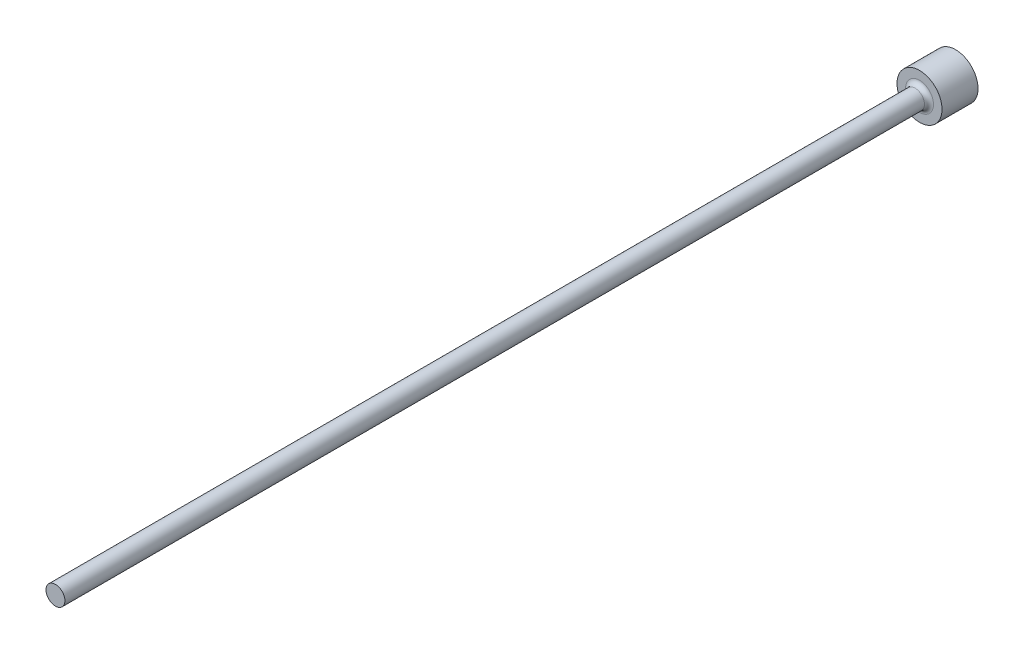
ISO-10303-21;
HEADER;
FILE_DESCRIPTION(('STEP AP214'),'2;1');
FILE_NAME('part.step','',(''),(''),'','','');
FILE_SCHEMA(('AUTOMOTIVE_DESIGN { 1 0 10303 214 1 1 1 1 }'));
ENDSEC;
DATA;
#1=APPLICATION_CONTEXT('core data for automotive mechanical design processes');
#2=APPLICATION_PROTOCOL_DEFINITION('international standard','automotive_design',2000,#1);
#3=PRODUCT_CONTEXT('',#1,'mechanical');
#4=PRODUCT('Part','Part','',(#3));
#5=PRODUCT_RELATED_PRODUCT_CATEGORY('part','',(#4));
#6=PRODUCT_DEFINITION_FORMATION('','',#4);
#7=PRODUCT_DEFINITION_CONTEXT('part definition',#1,'design');
#8=PRODUCT_DEFINITION('design','',#6,#7);
#9=PRODUCT_DEFINITION_SHAPE('','',#8);
#10=(LENGTH_UNIT() NAMED_UNIT(*) SI_UNIT(.MILLI.,.METRE.));
#11=(NAMED_UNIT(*) PLANE_ANGLE_UNIT() SI_UNIT($,.RADIAN.));
#12=(NAMED_UNIT(*) SI_UNIT($,.STERADIAN.) SOLID_ANGLE_UNIT());
#13=UNCERTAINTY_MEASURE_WITH_UNIT(LENGTH_MEASURE(1.E-05),#10,'distance_accuracy_value','');
#14=(GEOMETRIC_REPRESENTATION_CONTEXT(3) GLOBAL_UNCERTAINTY_ASSIGNED_CONTEXT((#13)) GLOBAL_UNIT_ASSIGNED_CONTEXT((#10,
#11,#12)) REPRESENTATION_CONTEXT('',''));
#15=CARTESIAN_POINT('',(0.,0.,0.));
#16=DIRECTION('',(0.,0.,1.));
#17=DIRECTION('',(1.,0.,0.));
#18=AXIS2_PLACEMENT_3D('',#15,#16,#17);
#19=CARTESIAN_POINT('',(2.5,0.,4.));
#20=DIRECTION('',(0.,0.,-1.));
#21=DIRECTION('',(-1.,0.,0.));
#22=AXIS2_PLACEMENT_3D('',#19,#20,#21);
#23=PLANE('',#22);
#24=CARTESIAN_POINT('',(0.,0.,4.));
#25=DIRECTION('',(0.,0.,-1.));
#26=DIRECTION('',(-1.,0.,0.));
#27=AXIS2_PLACEMENT_3D('',#24,#25,#26);
#28=CIRCLE('',#27,1.55000000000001);
#29=CARTESIAN_POINT('',(-1.55000000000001,0.,4.));
#30=VERTEX_POINT('',#29);
#31=EDGE_CURVE('E40',#30,#30,#28,.T.);
#32=ORIENTED_EDGE('',*,*,#31,.T.);
#33=EDGE_LOOP('',(#32));
#34=FACE_BOUND('',#33,.T.);
#35=CARTESIAN_POINT('',(0.,0.,4.));
#36=DIRECTION('',(0.,0.,-1.));
#37=DIRECTION('',(-1.,0.,0.));
#38=AXIS2_PLACEMENT_3D('',#35,#36,#37);
#39=CIRCLE('',#38,2.5);
#40=CARTESIAN_POINT('',(-2.5,0.,4.));
#41=VERTEX_POINT('',#40);
#42=EDGE_CURVE('E44',#41,#41,#39,.T.);
#43=ORIENTED_EDGE('',*,*,#42,.F.);
#44=EDGE_LOOP('',(#43));
#45=FACE_BOUND('',#44,.T.);
#46=ADVANCED_FACE('F33',(#34,#45),#23,.F.);
#47=CARTESIAN_POINT('',(0.,0.,-9.03322817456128));
#48=DIRECTION('',(0.,0.,-1.));
#49=DIRECTION('',(-1.,0.,0.));
#50=AXIS2_PLACEMENT_3D('',#47,#48,#49);
#51=CYLINDRICAL_SURFACE('',#50,2.5);
#52=CARTESIAN_POINT('',(0.,0.,0.));
#53=DIRECTION('',(0.,0.,-1.));
#54=DIRECTION('',(-1.,0.,0.));
#55=AXIS2_PLACEMENT_3D('',#52,#53,#54);
#56=CIRCLE('',#55,2.5);
#57=CARTESIAN_POINT('',(-2.5,0.,0.));
#58=VERTEX_POINT('',#57);
#59=EDGE_CURVE('E48',#58,#58,#56,.T.);
#60=ORIENTED_EDGE('',*,*,#59,.F.);
#61=EDGE_LOOP('',(#60));
#62=FACE_BOUND('',#61,.T.);
#63=ORIENTED_EDGE('',*,*,#42,.T.);
#64=EDGE_LOOP('',(#63));
#65=FACE_BOUND('',#64,.T.);
#66=ADVANCED_FACE('F68',(#62,#65),#51,.T.);
#67=CARTESIAN_POINT('',(0.,0.,0.));
#68=DIRECTION('',(0.,0.,1.));
#69=DIRECTION('',(1.,0.,0.));
#70=AXIS2_PLACEMENT_3D('',#67,#68,#69);
#71=PLANE('',#70);
#72=ORIENTED_EDGE('',*,*,#59,.T.);
#73=EDGE_LOOP('',(#72));
#74=FACE_BOUND('',#73,.T.);
#75=ADVANCED_FACE('F61',(#74),#71,.F.);
#76=CARTESIAN_POINT('',(0.,0.,100.));
#77=DIRECTION('',(0.,0.,-1.));
#78=DIRECTION('',(-1.,0.,0.));
#79=AXIS2_PLACEMENT_3D('',#76,#77,#78);
#80=PLANE('',#79);
#81=CARTESIAN_POINT('',(0.,0.,100.));
#82=DIRECTION('',(0.,0.,-1.));
#83=DIRECTION('',(-1.,0.,0.));
#84=AXIS2_PLACEMENT_3D('',#81,#82,#83);
#85=CIRCLE('',#84,1.05000000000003);
#86=CARTESIAN_POINT('',(-1.05000000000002,0.,100.));
#87=VERTEX_POINT('',#86);
#88=EDGE_CURVE('E53',#87,#87,#85,.T.);
#89=ORIENTED_EDGE('',*,*,#88,.F.);
#90=EDGE_LOOP('',(#89));
#91=FACE_BOUND('',#90,.T.);
#92=ADVANCED_FACE('F59',(#91),#80,.F.);
#93=CARTESIAN_POINT('',(0.,0.,-9.03322817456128));
#94=DIRECTION('',(0.,0.,-1.));
#95=DIRECTION('',(-1.,0.,0.));
#96=AXIS2_PLACEMENT_3D('',#93,#94,#95);
#97=CYLINDRICAL_SURFACE('',#96,1.05000000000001);
#98=CARTESIAN_POINT('',(0.,0.,4.5));
#99=DIRECTION('',(0.,0.,-1.));
#100=DIRECTION('',(-1.,0.,0.));
#101=AXIS2_PLACEMENT_3D('',#98,#99,#100);
#102=CIRCLE('',#101,1.05000000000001);
#103=CARTESIAN_POINT('',(-1.05000000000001,0.,4.5));
#104=VERTEX_POINT('',#103);
#105=EDGE_CURVE('E10',#104,#104,#102,.F.);
#106=ORIENTED_EDGE('',*,*,#105,.T.);
#107=EDGE_LOOP('',(#106));
#108=FACE_BOUND('',#107,.T.);
#109=ORIENTED_EDGE('',*,*,#88,.T.);
#110=EDGE_LOOP('',(#109));
#111=FACE_BOUND('',#110,.T.);
#112=ADVANCED_FACE('F57',(#108,#111),#97,.T.);
#113=CARTESIAN_POINT('',(0.,0.,4.5));
#114=DIRECTION('',(0.,0.,-1.));
#115=DIRECTION('',(-1.,0.,0.));
#116=AXIS2_PLACEMENT_3D('',#113,#114,#115);
#117=TOROIDAL_SURFACE('',#116,1.55000000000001,0.5);
#118=ORIENTED_EDGE('',*,*,#105,.F.);
#119=EDGE_LOOP('',(#118));
#120=FACE_BOUND('',#119,.T.);
#121=ORIENTED_EDGE('',*,*,#31,.F.);
#122=EDGE_LOOP('',(#121));
#123=FACE_BOUND('',#122,.T.);
#124=ADVANCED_FACE('F35',(#120,#123),#117,.F.);
#125=CLOSED_SHELL('',(#46,#66,#75,#92,#112,#124));
#126=MANIFOLD_SOLID_BREP('B2',#125);
#127=ADVANCED_BREP_SHAPE_REPRESENTATION('',(#18,#126),#14);
#128=SHAPE_DEFINITION_REPRESENTATION(#9,#127);
ENDSEC;
END-ISO-10303-21;
